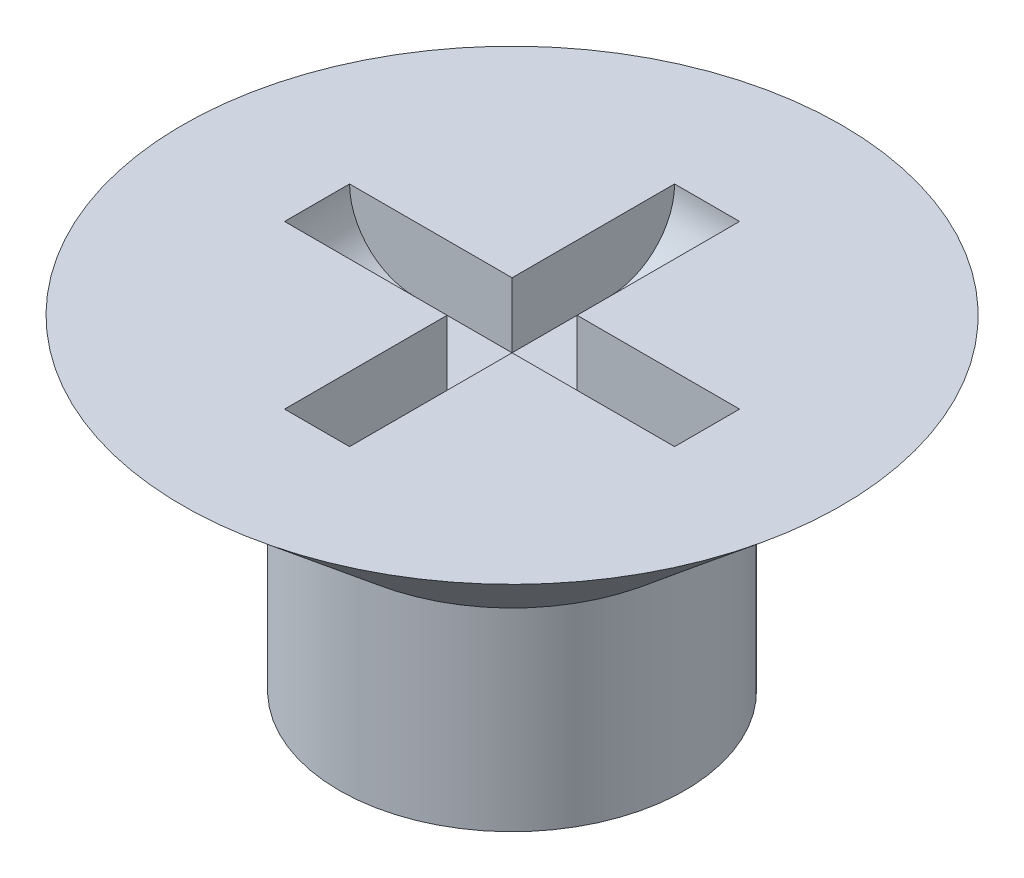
ISO-10303-21;
HEADER;
FILE_DESCRIPTION(('STEP AP214'),'2;1');
FILE_NAME('part.step','',(''),(''),'','','');
FILE_SCHEMA(('AUTOMOTIVE_DESIGN { 1 0 10303 214 1 1 1 1 }'));
ENDSEC;
DATA;
#1=APPLICATION_CONTEXT('core data for automotive mechanical design processes');
#2=APPLICATION_PROTOCOL_DEFINITION('international standard','automotive_design',2000,#1);
#3=PRODUCT_CONTEXT('',#1,'mechanical');
#4=PRODUCT('Part','Part','',(#3));
#5=PRODUCT_RELATED_PRODUCT_CATEGORY('part','',(#4));
#6=PRODUCT_DEFINITION_FORMATION('','',#4);
#7=PRODUCT_DEFINITION_CONTEXT('part definition',#1,'design');
#8=PRODUCT_DEFINITION('design','',#6,#7);
#9=PRODUCT_DEFINITION_SHAPE('','',#8);
#10=(LENGTH_UNIT() NAMED_UNIT(*) SI_UNIT(.MILLI.,.METRE.));
#11=(NAMED_UNIT(*) PLANE_ANGLE_UNIT() SI_UNIT($,.RADIAN.));
#12=(NAMED_UNIT(*) SI_UNIT($,.STERADIAN.) SOLID_ANGLE_UNIT());
#13=UNCERTAINTY_MEASURE_WITH_UNIT(LENGTH_MEASURE(1.E-05),#10,'distance_accuracy_value','');
#14=(GEOMETRIC_REPRESENTATION_CONTEXT(3) GLOBAL_UNCERTAINTY_ASSIGNED_CONTEXT((#13)) GLOBAL_UNIT_ASSIGNED_CONTEXT((#10,
#11,#12)) REPRESENTATION_CONTEXT('',''));
#15=CARTESIAN_POINT('',(0.,0.,0.));
#16=DIRECTION('',(0.,0.,1.));
#17=DIRECTION('',(1.,0.,0.));
#18=AXIS2_PLACEMENT_3D('',#15,#16,#17);
#19=CARTESIAN_POINT('',(0.,0.,-3.3782));
#20=DIRECTION('',(0.,-1.,0.));
#21=DIRECTION('',(0.,0.,-1.));
#22=AXIS2_PLACEMENT_3D('',#19,#20,#21);
#23=PLANE('',#22);
#24=CARTESIAN_POINT('',(0.,0.,0.));
#25=DIRECTION('',(0.,-1.,0.));
#26=DIRECTION('',(0.,0.,-1.));
#27=AXIS2_PLACEMENT_3D('',#24,#25,#26);
#28=CIRCLE('',#27,3.3782);
#29=CARTESIAN_POINT('',(0.,0.,-3.3782));
#30=VERTEX_POINT('',#29);
#31=EDGE_CURVE('E156',#30,#30,#28,.T.);
#32=ORIENTED_EDGE('',*,*,#31,.T.);
#33=EDGE_LOOP('',(#32));
#34=FACE_BOUND('',#33,.T.);
#35=ADVANCED_FACE('F33',(#34),#23,.T.);
#36=CARTESIAN_POINT('',(0.,6.35,0.));
#37=DIRECTION('',(0.,1.,0.));
#38=DIRECTION('',(0.,0.,1.));
#39=AXIS2_PLACEMENT_3D('',#36,#37,#38);
#40=PLANE('',#39);
#41=DIRECTION('',(1.,0.,0.));
#42=VECTOR('',#41,1.);
#43=CARTESIAN_POINT('',(0.,6.35,0.635));
#44=LINE('',#43,#42);
#45=CARTESIAN_POINT('',(-3.81,6.35,0.635));
#46=VERTEX_POINT('',#45);
#47=CARTESIAN_POINT('',(-0.635000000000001,6.35,0.635));
#48=VERTEX_POINT('',#47);
#49=EDGE_CURVE('E146',#46,#48,#44,.T.);
#50=ORIENTED_EDGE('',*,*,#49,.F.);
#51=DIRECTION('',(0.,0.,-1.));
#52=VECTOR('',#51,1.);
#53=CARTESIAN_POINT('',(-3.81,6.35,0.));
#54=LINE('',#53,#52);
#55=CARTESIAN_POINT('',(-3.81,6.35,-0.635));
#56=VERTEX_POINT('',#55);
#57=EDGE_CURVE('E142',#46,#56,#54,.T.);
#58=ORIENTED_EDGE('',*,*,#57,.T.);
#59=DIRECTION('',(1.,0.,0.));
#60=VECTOR('',#59,1.);
#61=CARTESIAN_POINT('',(0.,6.35,-0.635));
#62=LINE('',#61,#60);
#63=CARTESIAN_POINT('',(-0.635000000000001,6.35,-0.635));
#64=VERTEX_POINT('',#63);
#65=EDGE_CURVE('E221',#56,#64,#62,.T.);
#66=ORIENTED_EDGE('',*,*,#65,.T.);
#67=DIRECTION('',(0.,0.,-1.));
#68=VECTOR('',#67,1.);
#69=CARTESIAN_POINT('',(-0.635000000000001,6.35,0.));
#70=LINE('',#69,#68);
#71=CARTESIAN_POINT('',(-0.635000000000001,6.35,-3.81));
#72=VERTEX_POINT('',#71);
#73=EDGE_CURVE('E218',#64,#72,#70,.T.);
#74=ORIENTED_EDGE('',*,*,#73,.T.);
#75=DIRECTION('',(1.,0.,0.));
#76=VECTOR('',#75,1.);
#77=CARTESIAN_POINT('',(0.,6.35,-3.81));
#78=LINE('',#77,#76);
#79=CARTESIAN_POINT('',(0.634999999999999,6.35,-3.81));
#80=VERTEX_POINT('',#79);
#81=EDGE_CURVE('E215',#72,#80,#78,.T.);
#82=ORIENTED_EDGE('',*,*,#81,.T.);
#83=DIRECTION('',(0.,0.,-1.));
#84=VECTOR('',#83,1.);
#85=CARTESIAN_POINT('',(0.634999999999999,6.35,0.));
#86=LINE('',#85,#84);
#87=CARTESIAN_POINT('',(0.634999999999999,6.35,-0.635));
#88=VERTEX_POINT('',#87);
#89=EDGE_CURVE('E213',#88,#80,#86,.T.);
#90=ORIENTED_EDGE('',*,*,#89,.F.);
#91=DIRECTION('',(1.,0.,0.));
#92=VECTOR('',#91,1.);
#93=CARTESIAN_POINT('',(0.,6.35,-0.635));
#94=LINE('',#93,#92);
#95=CARTESIAN_POINT('',(3.81,6.35,-0.635));
#96=VERTEX_POINT('',#95);
#97=EDGE_CURVE('E210',#88,#96,#94,.T.);
#98=ORIENTED_EDGE('',*,*,#97,.T.);
#99=DIRECTION('',(0.,0.,-1.));
#100=VECTOR('',#99,1.);
#101=CARTESIAN_POINT('',(3.81,6.35,0.));
#102=LINE('',#101,#100);
#103=CARTESIAN_POINT('',(3.81,6.35,0.635000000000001));
#104=VERTEX_POINT('',#103);
#105=EDGE_CURVE('E207',#104,#96,#102,.T.);
#106=ORIENTED_EDGE('',*,*,#105,.F.);
#107=DIRECTION('',(1.,0.,0.));
#108=VECTOR('',#107,1.);
#109=CARTESIAN_POINT('',(0.,6.35,0.635));
#110=LINE('',#109,#108);
#111=CARTESIAN_POINT('',(0.634999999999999,6.35,0.635));
#112=VERTEX_POINT('',#111);
#113=EDGE_CURVE('E199',#112,#104,#110,.T.);
#114=ORIENTED_EDGE('',*,*,#113,.F.);
#115=DIRECTION('',(0.,0.,-1.));
#116=VECTOR('',#115,1.);
#117=CARTESIAN_POINT('',(0.634999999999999,6.35,0.));
#118=LINE('',#117,#116);
#119=CARTESIAN_POINT('',(0.634999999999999,6.35,3.81));
#120=VERTEX_POINT('',#119);
#121=EDGE_CURVE('E189',#120,#112,#118,.T.);
#122=ORIENTED_EDGE('',*,*,#121,.F.);
#123=DIRECTION('',(1.,0.,0.));
#124=VECTOR('',#123,1.);
#125=CARTESIAN_POINT('',(0.,6.35,3.81));
#126=LINE('',#125,#124);
#127=CARTESIAN_POINT('',(-0.635000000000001,6.35,3.81));
#128=VERTEX_POINT('',#127);
#129=EDGE_CURVE('E197',#128,#120,#126,.T.);
#130=ORIENTED_EDGE('',*,*,#129,.F.);
#131=DIRECTION('',(0.,0.,-1.));
#132=VECTOR('',#131,1.);
#133=CARTESIAN_POINT('',(-0.635000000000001,6.35,0.));
#134=LINE('',#133,#132);
#135=EDGE_CURVE('E201',#128,#48,#134,.T.);
#136=ORIENTED_EDGE('',*,*,#135,.T.);
#137=EDGE_LOOP('',(#50,#58,#66,#74,#82,#90,#98,#106,#114,#122,#130,#136));
#138=FACE_BOUND('',#137,.T.);
#139=CARTESIAN_POINT('',(0.,6.35,0.));
#140=DIRECTION('',(0.,-1.,0.));
#141=DIRECTION('',(0.,0.,-1.));
#142=AXIS2_PLACEMENT_3D('',#139,#140,#141);
#143=CIRCLE('',#142,6.4389);
#144=CARTESIAN_POINT('',(0.,6.35,-6.4389));
#145=VERTEX_POINT('',#144);
#146=EDGE_CURVE('E163',#145,#145,#143,.T.);
#147=ORIENTED_EDGE('',*,*,#146,.F.);
#148=EDGE_LOOP('',(#147));
#149=FACE_BOUND('',#148,.T.);
#150=ADVANCED_FACE('F195',(#138,#149),#40,.T.);
#151=CARTESIAN_POINT('',(0.,3.7846,0.));
#152=DIRECTION('',(0.,1.,0.));
#153=DIRECTION('',(0.,0.,1.));
#154=AXIS2_PLACEMENT_3D('',#151,#152,#153);
#155=CONICAL_SURFACE('',#154,3.3782,0.873207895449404);
#156=ORIENTED_EDGE('',*,*,#146,.T.);
#157=EDGE_LOOP('',(#156));
#158=FACE_BOUND('',#157,.T.);
#159=CARTESIAN_POINT('',(0.,3.7846,0.));
#160=DIRECTION('',(0.,-1.,0.));
#161=DIRECTION('',(0.,0.,-1.));
#162=AXIS2_PLACEMENT_3D('',#159,#160,#161);
#163=CIRCLE('',#162,3.3782);
#164=CARTESIAN_POINT('',(0.,3.7846,-3.3782));
#165=VERTEX_POINT('',#164);
#166=EDGE_CURVE('E159',#165,#165,#163,.T.);
#167=ORIENTED_EDGE('',*,*,#166,.F.);
#168=EDGE_LOOP('',(#167));
#169=FACE_BOUND('',#168,.T.);
#170=ADVANCED_FACE('F270',(#158,#169),#155,.T.);
#171=CARTESIAN_POINT('',(0.,0.,0.));
#172=DIRECTION('',(0.,-1.,0.));
#173=DIRECTION('',(0.,0.,-1.));
#174=AXIS2_PLACEMENT_3D('',#171,#172,#173);
#175=CYLINDRICAL_SURFACE('',#174,3.3782);
#176=ORIENTED_EDGE('',*,*,#166,.T.);
#177=EDGE_LOOP('',(#176));
#178=FACE_BOUND('',#177,.T.);
#179=ORIENTED_EDGE('',*,*,#31,.F.);
#180=EDGE_LOOP('',(#179));
#181=FACE_BOUND('',#180,.T.);
#182=ADVANCED_FACE('F291',(#178,#181),#175,.T.);
#183=CARTESIAN_POINT('',(0.,5.08,0.635));
#184=DIRECTION('',(0.,0.,1.));
#185=DIRECTION('',(1.,0.,0.));
#186=AXIS2_PLACEMENT_3D('',#183,#184,#185);
#187=PLANE('',#186);
#188=DIRECTION('',(1.,0.,0.));
#189=VECTOR('',#188,1.);
#190=CARTESIAN_POINT('',(0.,5.08,0.635));
#191=LINE('',#190,#189);
#192=CARTESIAN_POINT('',(-2.54,5.08,0.635));
#193=VERTEX_POINT('',#192);
#194=CARTESIAN_POINT('',(-0.635000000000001,5.08,0.635));
#195=VERTEX_POINT('',#194);
#196=EDGE_CURVE('E133',#193,#195,#191,.T.);
#197=ORIENTED_EDGE('',*,*,#196,.F.);
#198=CARTESIAN_POINT('',(-2.54,6.35,0.635));
#199=DIRECTION('',(0.,0.,1.));
#200=DIRECTION('',(1.,0.,0.));
#201=AXIS2_PLACEMENT_3D('',#198,#199,#200);
#202=CIRCLE('',#201,1.27);
#203=EDGE_CURVE('E175',#193,#46,#202,.F.);
#204=ORIENTED_EDGE('',*,*,#203,.T.);
#205=ORIENTED_EDGE('',*,*,#49,.T.);
#206=DIRECTION('',(0.,1.,0.));
#207=VECTOR('',#206,1.);
#208=CARTESIAN_POINT('',(-0.635000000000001,5.08,0.635));
#209=LINE('',#208,#207);
#210=EDGE_CURVE('E127',#195,#48,#209,.T.);
#211=ORIENTED_EDGE('',*,*,#210,.F.);
#212=EDGE_LOOP('',(#197,#204,#205,#211));
#213=FACE_BOUND('',#212,.T.);
#214=ADVANCED_FACE('F144',(#213),#187,.F.);
#215=CARTESIAN_POINT('',(0.,5.08,-0.635));
#216=DIRECTION('',(0.,0.,1.));
#217=DIRECTION('',(1.,0.,0.));
#218=AXIS2_PLACEMENT_3D('',#215,#216,#217);
#219=PLANE('',#218);
#220=ORIENTED_EDGE('',*,*,#65,.F.);
#221=CARTESIAN_POINT('',(-2.54,6.35,-0.635));
#222=DIRECTION('',(0.,0.,1.));
#223=DIRECTION('',(1.,0.,0.));
#224=AXIS2_PLACEMENT_3D('',#221,#222,#223);
#225=CIRCLE('',#224,1.27);
#226=CARTESIAN_POINT('',(-2.54,5.08,-0.635));
#227=VERTEX_POINT('',#226);
#228=EDGE_CURVE('E166',#56,#227,#225,.T.);
#229=ORIENTED_EDGE('',*,*,#228,.T.);
#230=DIRECTION('',(1.,0.,0.));
#231=VECTOR('',#230,1.);
#232=CARTESIAN_POINT('',(0.,5.08,-0.635));
#233=LINE('',#232,#231);
#234=CARTESIAN_POINT('',(-0.635000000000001,5.08,-0.635));
#235=VERTEX_POINT('',#234);
#236=EDGE_CURVE('E148',#227,#235,#233,.T.);
#237=ORIENTED_EDGE('',*,*,#236,.T.);
#238=DIRECTION('',(0.,1.,0.));
#239=VECTOR('',#238,1.);
#240=CARTESIAN_POINT('',(-0.635000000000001,5.08,-0.635));
#241=LINE('',#240,#239);
#242=EDGE_CURVE('E160',#235,#64,#241,.T.);
#243=ORIENTED_EDGE('',*,*,#242,.T.);
#244=EDGE_LOOP('',(#220,#229,#237,#243));
#245=FACE_BOUND('',#244,.T.);
#246=ADVANCED_FACE('F283',(#245),#219,.T.);
#247=CARTESIAN_POINT('',(-0.635000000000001,5.08,0.));
#248=DIRECTION('',(1.,0.,0.));
#249=DIRECTION('',(0.,0.,-1.));
#250=AXIS2_PLACEMENT_3D('',#247,#248,#249);
#251=PLANE('',#250);
#252=DIRECTION('',(0.,0.,-1.));
#253=VECTOR('',#252,1.);
#254=CARTESIAN_POINT('',(-0.635000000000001,5.08,0.));
#255=LINE('',#254,#253);
#256=CARTESIAN_POINT('',(-0.635000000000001,5.08,-2.54));
#257=VERTEX_POINT('',#256);
#258=EDGE_CURVE('E152',#235,#257,#255,.T.);
#259=ORIENTED_EDGE('',*,*,#258,.T.);
#260=CARTESIAN_POINT('',(-0.635000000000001,6.35,-2.54));
#261=DIRECTION('',(1.,0.,0.));
#262=DIRECTION('',(0.,0.,-1.));
#263=AXIS2_PLACEMENT_3D('',#260,#261,#262);
#264=CIRCLE('',#263,1.27);
#265=EDGE_CURVE('E178',#257,#72,#264,.T.);
#266=ORIENTED_EDGE('',*,*,#265,.T.);
#267=ORIENTED_EDGE('',*,*,#73,.F.);
#268=ORIENTED_EDGE('',*,*,#242,.F.);
#269=EDGE_LOOP('',(#259,#266,#267,#268));
#270=FACE_BOUND('',#269,.T.);
#271=ADVANCED_FACE('F240',(#270),#251,.T.);
#272=CARTESIAN_POINT('',(0.634999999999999,5.08,0.));
#273=DIRECTION('',(1.,0.,0.));
#274=DIRECTION('',(0.,0.,-1.));
#275=AXIS2_PLACEMENT_3D('',#272,#273,#274);
#276=PLANE('',#275);
#277=ORIENTED_EDGE('',*,*,#89,.T.);
#278=CARTESIAN_POINT('',(0.634999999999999,6.35,-2.54));
#279=DIRECTION('',(1.,0.,0.));
#280=DIRECTION('',(0.,0.,-1.));
#281=AXIS2_PLACEMENT_3D('',#278,#279,#280);
#282=CIRCLE('',#281,1.27);
#283=CARTESIAN_POINT('',(0.634999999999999,5.08,-2.54));
#284=VERTEX_POINT('',#283);
#285=EDGE_CURVE('E56',#80,#284,#282,.F.);
#286=ORIENTED_EDGE('',*,*,#285,.T.);
#287=DIRECTION('',(0.,0.,-1.));
#288=VECTOR('',#287,1.);
#289=CARTESIAN_POINT('',(0.634999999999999,5.08,0.));
#290=LINE('',#289,#288);
#291=CARTESIAN_POINT('',(0.634999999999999,5.08,-0.635));
#292=VERTEX_POINT('',#291);
#293=EDGE_CURVE('E229',#292,#284,#290,.T.);
#294=ORIENTED_EDGE('',*,*,#293,.F.);
#295=DIRECTION('',(0.,1.,0.));
#296=VECTOR('',#295,1.);
#297=CARTESIAN_POINT('',(0.634999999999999,5.08,-0.635));
#298=LINE('',#297,#296);
#299=EDGE_CURVE('E150',#292,#88,#298,.T.);
#300=ORIENTED_EDGE('',*,*,#299,.T.);
#301=EDGE_LOOP('',(#277,#286,#294,#300));
#302=FACE_BOUND('',#301,.T.);
#303=ADVANCED_FACE('F227',(#302),#276,.F.);
#304=CARTESIAN_POINT('',(0.,5.08,-0.635));
#305=DIRECTION('',(0.,0.,1.));
#306=DIRECTION('',(1.,0.,0.));
#307=AXIS2_PLACEMENT_3D('',#304,#305,#306);
#308=PLANE('',#307);
#309=DIRECTION('',(1.,0.,0.));
#310=VECTOR('',#309,1.);
#311=CARTESIAN_POINT('',(0.,5.08,-0.635));
#312=LINE('',#311,#310);
#313=CARTESIAN_POINT('',(2.54,5.08,-0.635));
#314=VERTEX_POINT('',#313);
#315=EDGE_CURVE('E243',#292,#314,#312,.T.);
#316=ORIENTED_EDGE('',*,*,#315,.T.);
#317=CARTESIAN_POINT('',(2.54,6.35,-0.635));
#318=DIRECTION('',(0.,0.,1.));
#319=DIRECTION('',(1.,0.,0.));
#320=AXIS2_PLACEMENT_3D('',#317,#318,#319);
#321=CIRCLE('',#320,1.27);
#322=EDGE_CURVE('E180',#314,#96,#321,.T.);
#323=ORIENTED_EDGE('',*,*,#322,.T.);
#324=ORIENTED_EDGE('',*,*,#97,.F.);
#325=ORIENTED_EDGE('',*,*,#299,.F.);
#326=EDGE_LOOP('',(#316,#323,#324,#325));
#327=FACE_BOUND('',#326,.T.);
#328=ADVANCED_FACE('F233',(#327),#308,.T.);
#329=CARTESIAN_POINT('',(0.,5.08,0.635));
#330=DIRECTION('',(0.,0.,1.));
#331=DIRECTION('',(1.,0.,0.));
#332=AXIS2_PLACEMENT_3D('',#329,#330,#331);
#333=PLANE('',#332);
#334=ORIENTED_EDGE('',*,*,#113,.T.);
#335=CARTESIAN_POINT('',(2.54,6.35,0.635000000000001));
#336=DIRECTION('',(0.,0.,1.));
#337=DIRECTION('',(1.,0.,0.));
#338=AXIS2_PLACEMENT_3D('',#335,#336,#337);
#339=CIRCLE('',#338,1.27);
#340=CARTESIAN_POINT('',(2.54,5.08,0.635000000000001));
#341=VERTEX_POINT('',#340);
#342=EDGE_CURVE('E182',#104,#341,#339,.F.);
#343=ORIENTED_EDGE('',*,*,#342,.T.);
#344=DIRECTION('',(1.,0.,0.));
#345=VECTOR('',#344,1.);
#346=CARTESIAN_POINT('',(0.,5.08,0.635));
#347=LINE('',#346,#345);
#348=CARTESIAN_POINT('',(0.634999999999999,5.08,0.635));
#349=VERTEX_POINT('',#348);
#350=EDGE_CURVE('E247',#349,#341,#347,.T.);
#351=ORIENTED_EDGE('',*,*,#350,.F.);
#352=DIRECTION('',(0.,1.,0.));
#353=VECTOR('',#352,1.);
#354=CARTESIAN_POINT('',(0.634999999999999,5.08,0.635));
#355=LINE('',#354,#353);
#356=EDGE_CURVE('E147',#349,#112,#355,.T.);
#357=ORIENTED_EDGE('',*,*,#356,.T.);
#358=EDGE_LOOP('',(#334,#343,#351,#357));
#359=FACE_BOUND('',#358,.T.);
#360=ADVANCED_FACE('F253',(#359),#333,.F.);
#361=CARTESIAN_POINT('',(0.634999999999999,5.08,0.));
#362=DIRECTION('',(1.,0.,0.));
#363=DIRECTION('',(0.,0.,-1.));
#364=AXIS2_PLACEMENT_3D('',#361,#362,#363);
#365=PLANE('',#364);
#366=DIRECTION('',(0.,0.,-1.));
#367=VECTOR('',#366,1.);
#368=CARTESIAN_POINT('',(0.634999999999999,5.08,0.));
#369=LINE('',#368,#367);
#370=CARTESIAN_POINT('',(0.634999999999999,5.08,2.54));
#371=VERTEX_POINT('',#370);
#372=EDGE_CURVE('E132',#371,#349,#369,.T.);
#373=ORIENTED_EDGE('',*,*,#372,.F.);
#374=CARTESIAN_POINT('',(0.634999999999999,6.35,2.54));
#375=DIRECTION('',(1.,0.,0.));
#376=DIRECTION('',(0.,0.,-1.));
#377=AXIS2_PLACEMENT_3D('',#374,#375,#376);
#378=CIRCLE('',#377,1.27);
#379=EDGE_CURVE('E41',#371,#120,#378,.F.);
#380=ORIENTED_EDGE('',*,*,#379,.T.);
#381=ORIENTED_EDGE('',*,*,#121,.T.);
#382=ORIENTED_EDGE('',*,*,#356,.F.);
#383=EDGE_LOOP('',(#373,#380,#381,#382));
#384=FACE_BOUND('',#383,.T.);
#385=ADVANCED_FACE('F187',(#384),#365,.F.);
#386=CARTESIAN_POINT('',(-0.635000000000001,5.08,0.));
#387=DIRECTION('',(1.,0.,0.));
#388=DIRECTION('',(0.,0.,-1.));
#389=AXIS2_PLACEMENT_3D('',#386,#387,#388);
#390=PLANE('',#389);
#391=ORIENTED_EDGE('',*,*,#135,.F.);
#392=CARTESIAN_POINT('',(-0.635000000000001,6.35,2.54));
#393=DIRECTION('',(1.,0.,0.));
#394=DIRECTION('',(0.,0.,-1.));
#395=AXIS2_PLACEMENT_3D('',#392,#393,#394);
#396=CIRCLE('',#395,1.27);
#397=CARTESIAN_POINT('',(-0.635000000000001,5.08,2.54));
#398=VERTEX_POINT('',#397);
#399=EDGE_CURVE('E11',#128,#398,#396,.T.);
#400=ORIENTED_EDGE('',*,*,#399,.T.);
#401=DIRECTION('',(0.,0.,-1.));
#402=VECTOR('',#401,1.);
#403=CARTESIAN_POINT('',(-0.635000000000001,5.08,0.));
#404=LINE('',#403,#402);
#405=EDGE_CURVE('E123',#398,#195,#404,.T.);
#406=ORIENTED_EDGE('',*,*,#405,.T.);
#407=ORIENTED_EDGE('',*,*,#210,.T.);
#408=EDGE_LOOP('',(#391,#400,#406,#407));
#409=FACE_BOUND('',#408,.T.);
#410=ADVANCED_FACE('F125',(#409),#390,.T.);
#411=CARTESIAN_POINT('',(0.,5.08,0.));
#412=DIRECTION('',(0.,1.,0.));
#413=DIRECTION('',(0.,0.,1.));
#414=AXIS2_PLACEMENT_3D('',#411,#412,#413);
#415=PLANE('',#414);
#416=ORIENTED_EDGE('',*,*,#236,.F.);
#417=DIRECTION('',(0.,0.,-1.));
#418=VECTOR('',#417,1.);
#419=CARTESIAN_POINT('',(-2.54,5.08,0.635));
#420=LINE('',#419,#418);
#421=EDGE_CURVE('E139',#227,#193,#420,.F.);
#422=ORIENTED_EDGE('',*,*,#421,.T.);
#423=ORIENTED_EDGE('',*,*,#196,.T.);
#424=ORIENTED_EDGE('',*,*,#405,.F.);
#425=DIRECTION('',(1.,0.,0.));
#426=VECTOR('',#425,1.);
#427=CARTESIAN_POINT('',(0.,5.08,2.54));
#428=LINE('',#427,#426);
#429=EDGE_CURVE('E168',#398,#371,#428,.T.);
#430=ORIENTED_EDGE('',*,*,#429,.T.);
#431=ORIENTED_EDGE('',*,*,#372,.T.);
#432=ORIENTED_EDGE('',*,*,#350,.T.);
#433=DIRECTION('',(0.,0.,-1.));
#434=VECTOR('',#433,1.);
#435=CARTESIAN_POINT('',(2.54,5.08,0.));
#436=LINE('',#435,#434);
#437=EDGE_CURVE('E170',#341,#314,#436,.T.);
#438=ORIENTED_EDGE('',*,*,#437,.T.);
#439=ORIENTED_EDGE('',*,*,#315,.F.);
#440=ORIENTED_EDGE('',*,*,#293,.T.);
#441=DIRECTION('',(1.,0.,0.));
#442=VECTOR('',#441,1.);
#443=CARTESIAN_POINT('',(-0.635,5.08,-2.54));
#444=LINE('',#443,#442);
#445=EDGE_CURVE('E48',#284,#257,#444,.F.);
#446=ORIENTED_EDGE('',*,*,#445,.T.);
#447=ORIENTED_EDGE('',*,*,#258,.F.);
#448=EDGE_LOOP('',(#416,#422,#423,#424,#430,#431,#432,#438,#439,#440,#446,#447));
#449=FACE_BOUND('',#448,.T.);
#450=ADVANCED_FACE('F137',(#449),#415,.T.);
#451=CARTESIAN_POINT('',(-2.54,6.35,0.));
#452=DIRECTION('',(0.,0.,1.));
#453=DIRECTION('',(1.,0.,0.));
#454=AXIS2_PLACEMENT_3D('',#451,#452,#453);
#455=CYLINDRICAL_SURFACE('',#454,1.27);
#456=ORIENTED_EDGE('',*,*,#203,.F.);
#457=ORIENTED_EDGE('',*,*,#421,.F.);
#458=ORIENTED_EDGE('',*,*,#228,.F.);
#459=ORIENTED_EDGE('',*,*,#57,.F.);
#460=EDGE_LOOP('',(#456,#457,#458,#459));
#461=FACE_BOUND('',#460,.T.);
#462=ADVANCED_FACE('F262',(#461),#455,.F.);
#463=CARTESIAN_POINT('',(0.,6.35,-2.54));
#464=DIRECTION('',(-1.,0.,0.));
#465=DIRECTION('',(0.,0.,1.));
#466=AXIS2_PLACEMENT_3D('',#463,#464,#465);
#467=CYLINDRICAL_SURFACE('',#466,1.27);
#468=ORIENTED_EDGE('',*,*,#265,.F.);
#469=ORIENTED_EDGE('',*,*,#445,.F.);
#470=ORIENTED_EDGE('',*,*,#285,.F.);
#471=ORIENTED_EDGE('',*,*,#81,.F.);
#472=EDGE_LOOP('',(#468,#469,#470,#471));
#473=FACE_BOUND('',#472,.T.);
#474=ADVANCED_FACE('F238',(#473),#467,.F.);
#475=CARTESIAN_POINT('',(2.54,6.35,0.));
#476=DIRECTION('',(0.,0.,-1.));
#477=DIRECTION('',(-1.,0.,0.));
#478=AXIS2_PLACEMENT_3D('',#475,#476,#477);
#479=CYLINDRICAL_SURFACE('',#478,1.27);
#480=ORIENTED_EDGE('',*,*,#342,.F.);
#481=ORIENTED_EDGE('',*,*,#105,.T.);
#482=ORIENTED_EDGE('',*,*,#322,.F.);
#483=ORIENTED_EDGE('',*,*,#437,.F.);
#484=EDGE_LOOP('',(#480,#481,#482,#483));
#485=FACE_BOUND('',#484,.T.);
#486=ADVANCED_FACE('F256',(#485),#479,.F.);
#487=CARTESIAN_POINT('',(0.,6.35,2.54));
#488=DIRECTION('',(1.,0.,0.));
#489=DIRECTION('',(0.,0.,-1.));
#490=AXIS2_PLACEMENT_3D('',#487,#488,#489);
#491=CYLINDRICAL_SURFACE('',#490,1.27);
#492=ORIENTED_EDGE('',*,*,#399,.F.);
#493=ORIENTED_EDGE('',*,*,#129,.T.);
#494=ORIENTED_EDGE('',*,*,#379,.F.);
#495=ORIENTED_EDGE('',*,*,#429,.F.);
#496=EDGE_LOOP('',(#492,#493,#494,#495));
#497=FACE_BOUND('',#496,.T.);
#498=ADVANCED_FACE('F35',(#497),#491,.F.);
#499=CLOSED_SHELL('',(#35,#150,#170,#182,#214,#246,#271,#303,#328,#360,#385,#410,#450,#462,#474,
#486,#498));
#500=MANIFOLD_SOLID_BREP('B2',#499);
#501=ADVANCED_BREP_SHAPE_REPRESENTATION('',(#18,#500),#14);
#502=SHAPE_DEFINITION_REPRESENTATION(#9,#501);
ENDSEC;
END-ISO-10303-21;
